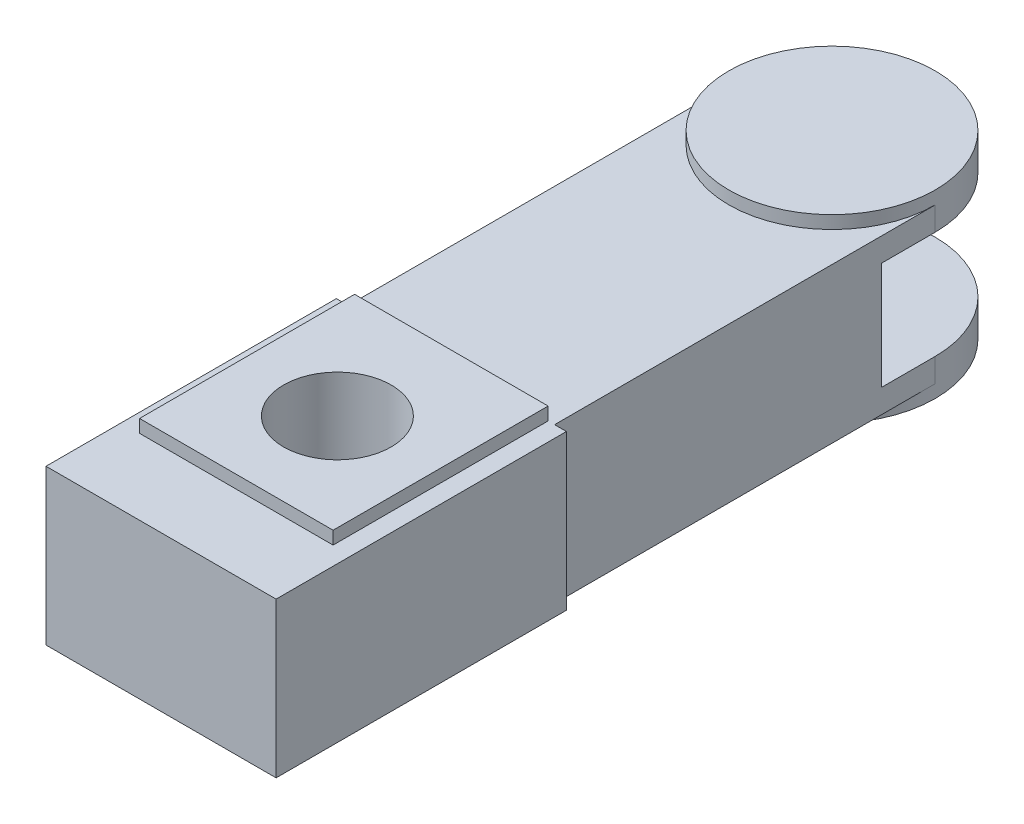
from build123d import *

# Parameters (mm, degrees)
EXTRUDE1_DEPTH     = 36
SKETCH2_R          = 48
SKETCH2_W          = 90
SKETCH2_H          = 100
EXTRUDE2_DEPTH     = 42
SKETCH4_R          = 48
CUT_EXTRUDE1_DEPTH = 25
SKETCH5_W          = 25
SKETCH5_H          = 50
CUT_EXTRUDE2_DEPTH = 377.385772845
SKETCH3_R          = 25
CUT_EXTRUDE3_DEPTH = 50


with BuildPart() as part:
    # Sketch1 → Extrude1 (new, symmetric)
    with BuildSketch(Plane(origin=(0, 0, 0), x_dir=(1, 0, 0), z_dir=(0, 1, 0))):
        with BuildLine():
            Line((48, 135), (48, 312))
            ThreePointArc((48, 312), (0, 360), (-48, 312))
            Line((-48, 312), (-48, 135))
            Line((-48, 135), (-53.5, 135))
            Line((-53.5, 135), (-53.5, 0))
            Line((-53.5, 0), (53.5, 0))
            Line((53.5, 0), (53.5, 135))
            Line((53.5, 135), (48, 135))
        make_face()
    extrude(amount=EXTRUDE1_DEPTH, both=True)

    # Sketch2 → Extrude2 (add, symmetric)
    with BuildSketch(Plane(origin=(0, 0, 0), x_dir=(1, 0, 0), z_dir=(0, 1, 0))):
        with Locations((0, 312)):
            Circle(SKETCH2_R)
        with Locations((0, 85)):
            Rectangle(SKETCH2_W, SKETCH2_H)
    extrude(amount=EXTRUDE2_DEPTH, both=True)

    # Sketch4 → Cut-Extrude1 (cut, symmetric)
    with BuildSketch(Plane(origin=(0, 0, 0), x_dir=(1, 0, 0), z_dir=(0, 1, 0))):
        with Locations((0, 312)):
            Circle(SKETCH4_R)
    extrude(amount=CUT_EXTRUDE1_DEPTH, both=True, mode=Mode.SUBTRACT)

    # Sketch5 → Cut-Extrude2 (cut, through all)
    with BuildSketch(Plane(origin=(48, 0, 0), x_dir=(0, 0, -1), z_dir=(1, 0, 0))):
        with Locations((299.5, 0)):
            Rectangle(SKETCH5_W, SKETCH5_H)
    extrude(amount=-CUT_EXTRUDE2_DEPTH, mode=Mode.SUBTRACT)

    # Sketch3 → Cut-Extrude3 (cut)
    with BuildSketch(Plane(origin=(0, 42, 0), x_dir=(-1, 0, 0), z_dir=(0, 1, 0))):
        with Locations(Location((0, -82, 0), (0, 0, 90))):
            Circle(SKETCH3_R)
    extrude(amount=-CUT_EXTRUDE3_DEPTH, mode=Mode.SUBTRACT)


solid = part.part
